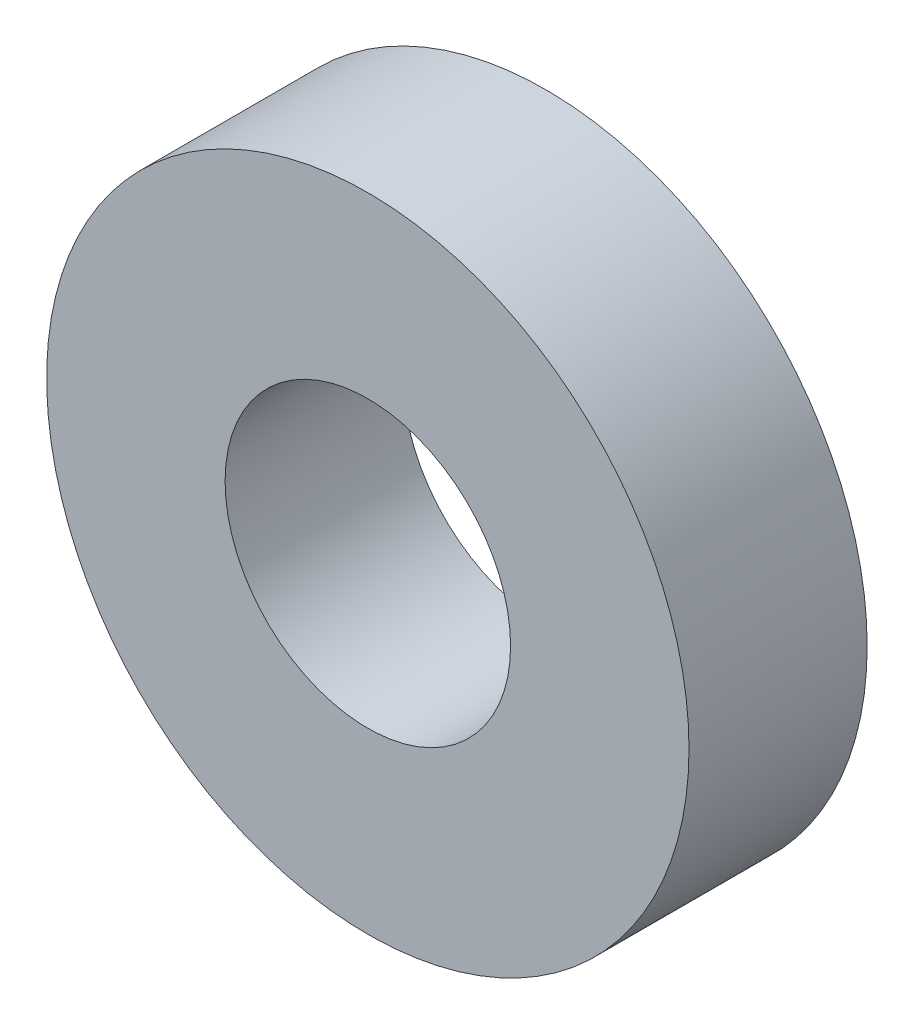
from build123d import *

# Parameters (mm, degrees)
SKETCH1_R           = 14.2875
SKETCH1_R_2         = 6.35
BOSS_EXTRUDE1_DEPTH = 7.9248


with BuildPart() as part:
    # Sketch1 → Boss-Extrude1 (new body)
    with BuildSketch(Plane.XY):
        Circle(SKETCH1_R)
        Circle(SKETCH1_R_2, mode=Mode.SUBTRACT)
    extrude(amount=BOSS_EXTRUDE1_DEPTH)


solid = part.part
